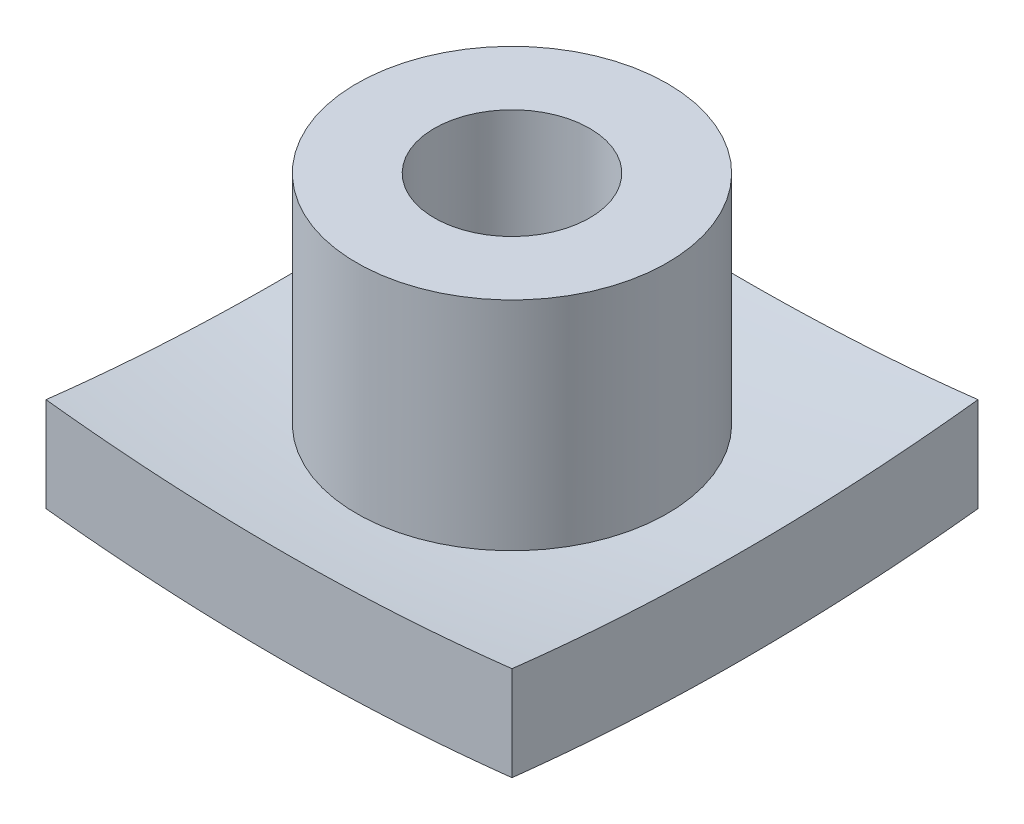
from build123d import *

# Parameters (mm, degrees)
ESQUISSE1_W             = 6
ESQUISSE1_H             = 6
BOSS_EXTRU_1_DEPTH      = 4
ESQUISSE3_R             = 1
ENL_V_MAT_EXTRU_1_DEPTH = 6.830951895


with BuildPart() as part:
    # Esquisse1 → Boss.-Extru.1 (new body)
    with BuildSketch(Plane(origin=(0, 0, 0), x_dir=(1, 0, 0), z_dir=(0, 1, 0))):
        Rectangle(ESQUISSE1_W, ESQUISSE1_H)
    extrude(amount=BOSS_EXTRU_1_DEPTH)

    # Esquisse2 → Enl_vement de mati_re-R_volution1 (revolve, cut)
    with BuildSketch(Plane.XY, mode=Mode.PRIVATE) as enl_vement_de_mati_re_r_volution1_sk:
        with BuildLine():
            Line((-5, 0), (-2, 0))
            ThreePointArc((-2, 0), (-3.505421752, 0.153159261), (-5, 0.389777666))
            Line((-5, 0.389777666), (-5, 0))
        make_face()
        with BuildLine():
            Line((-5, 4), (-2, 4))
            Line((-2, 4), (-2, 1.203406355))
            ThreePointArc((-2, 1.203406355), (-3.505944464, 1.363788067), (-5, 1.611556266))
            Line((-5, 1.611556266), (-5, 4))
        make_face()
    revolve(enl_vement_de_mati_re_r_volution1_sk.sketch.rotate(Axis((0, 0, 0), (0, 1, 0)), 315), axis=Axis((0, 0, 0), (0, 1, 0)), mode=Mode.SUBTRACT)

    # Esquisse3 → Enl_v. mat.-Extru.1 (cut, through all)
    with BuildSketch(Plane.XZ):
        with Locations(Location((0, 0, 0), (0, 0, 270))):
            Circle(ESQUISSE3_R)
    extrude(amount=-ENL_V_MAT_EXTRU_1_DEPTH, mode=Mode.SUBTRACT)


solid = part.part
